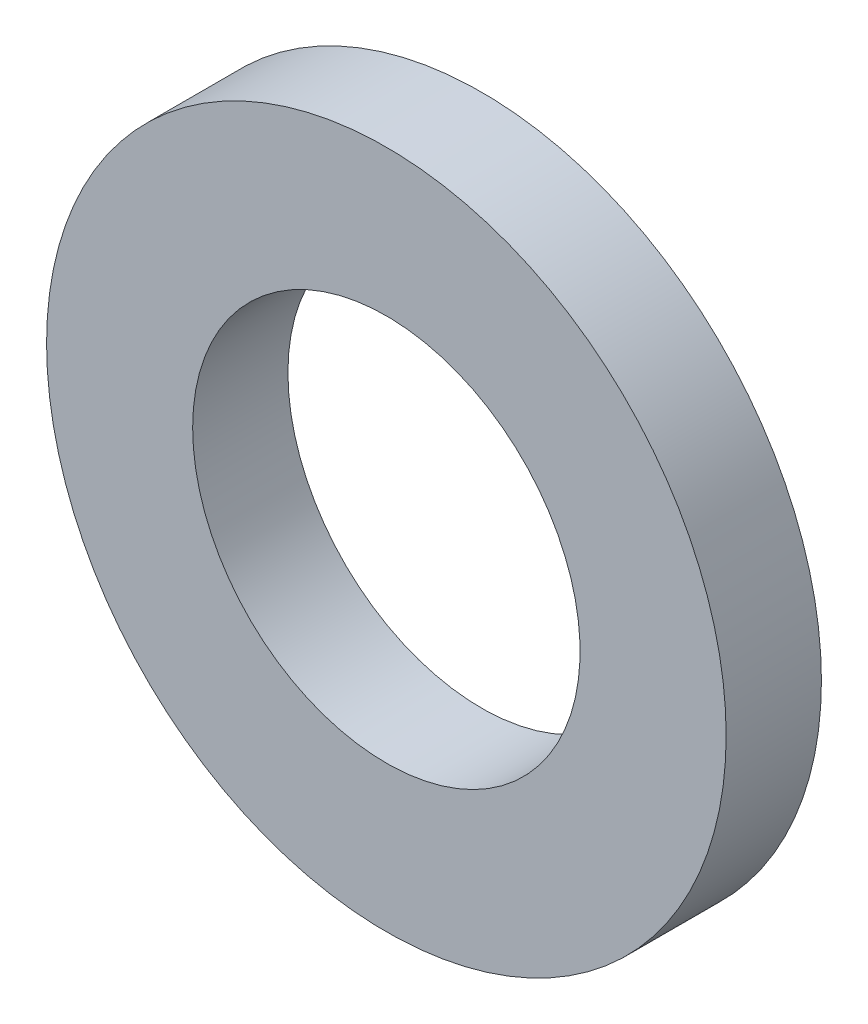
from build123d import *

# Parameters (mm, degrees)
SKETCH1_R          = 5.35
SKETCH1_R_2        = 3.05
BASE_EXTRUDE_DEPTH = 1.5


with BuildPart() as part:
    # Sketch1 → Base-Extrude (new body)
    with BuildSketch(Plane.XY):
        Circle(SKETCH1_R)
        Circle(SKETCH1_R_2, mode=Mode.SUBTRACT)
    extrude(amount=BASE_EXTRUDE_DEPTH)


solid = part.part
